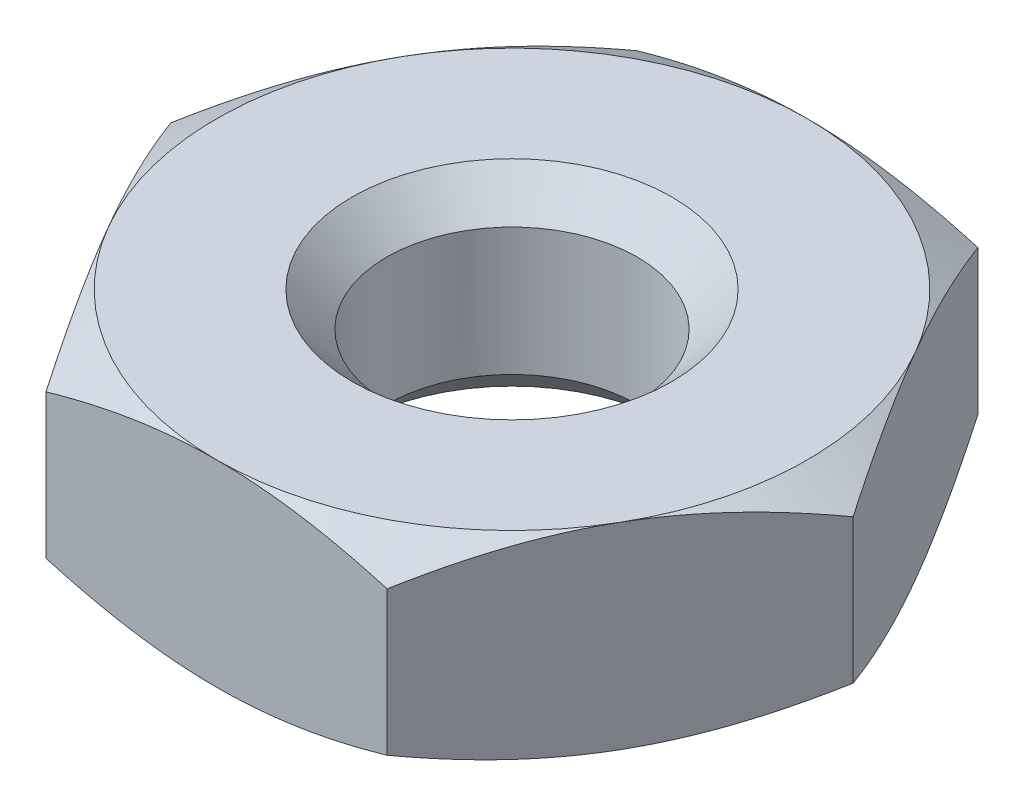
ISO-10303-21;
HEADER;
FILE_DESCRIPTION(('STEP AP214'),'2;1');
FILE_NAME('part.step','',(''),(''),'','','');
FILE_SCHEMA(('AUTOMOTIVE_DESIGN { 1 0 10303 214 1 1 1 1 }'));
ENDSEC;
DATA;
#1=APPLICATION_CONTEXT('core data for automotive mechanical design processes');
#2=APPLICATION_PROTOCOL_DEFINITION('international standard','automotive_design',2000,#1);
#3=PRODUCT_CONTEXT('',#1,'mechanical');
#4=PRODUCT('Part','Part','',(#3));
#5=PRODUCT_RELATED_PRODUCT_CATEGORY('part','',(#4));
#6=PRODUCT_DEFINITION_FORMATION('','',#4);
#7=PRODUCT_DEFINITION_CONTEXT('part definition',#1,'design');
#8=PRODUCT_DEFINITION('design','',#6,#7);
#9=PRODUCT_DEFINITION_SHAPE('','',#8);
#10=(LENGTH_UNIT() NAMED_UNIT(*) SI_UNIT(.MILLI.,.METRE.));
#11=(NAMED_UNIT(*) PLANE_ANGLE_UNIT() SI_UNIT($,.RADIAN.));
#12=(NAMED_UNIT(*) SI_UNIT($,.STERADIAN.) SOLID_ANGLE_UNIT());
#13=UNCERTAINTY_MEASURE_WITH_UNIT(LENGTH_MEASURE(1.E-05),#10,'distance_accuracy_value','');
#14=(GEOMETRIC_REPRESENTATION_CONTEXT(3) GLOBAL_UNCERTAINTY_ASSIGNED_CONTEXT((#13)) GLOBAL_UNIT_ASSIGNED_CONTEXT((#10,
#11,#12)) REPRESENTATION_CONTEXT('',''));
#15=CARTESIAN_POINT('',(0.,0.,0.));
#16=DIRECTION('',(0.,0.,1.));
#17=DIRECTION('',(1.,0.,0.));
#18=AXIS2_PLACEMENT_3D('',#15,#16,#17);
#19=CARTESIAN_POINT('',(0.,-1.09676599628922,21.2574156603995));
#20=DIRECTION('',(0.,1.,0.));
#21=DIRECTION('',(0.,0.,1.));
#22=AXIS2_PLACEMENT_3D('',#19,#20,#21);
#23=PLANE('',#22);
#24=CARTESIAN_POINT('',(0.,-1.09676599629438,23.8460454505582));
#25=DIRECTION('',(0.,-1.,0.));
#26=DIRECTION('',(0.,0.,-1.));
#27=AXIS2_PLACEMENT_3D('',#24,#25,#26);
#28=CIRCLE('',#27,4.76250000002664);
#29=CARTESIAN_POINT('',(4.12444598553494,-1.09676599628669,26.2272954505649));
#30=VERTEX_POINT('',#29);
#31=CARTESIAN_POINT('',(0.,-1.09676599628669,28.6085454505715));
#32=VERTEX_POINT('',#31);
#33=EDGE_CURVE('E125',#30,#32,#28,.T.);
#34=ORIENTED_EDGE('',*,*,#33,.F.);
#35=CARTESIAN_POINT('',(0.,-1.09676599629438,23.8460454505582));
#36=DIRECTION('',(0.,-1.,0.));
#37=DIRECTION('',(0.,0.,-1.));
#38=AXIS2_PLACEMENT_3D('',#35,#36,#37);
#39=CIRCLE('',#38,4.76250000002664);
#40=CARTESIAN_POINT('',(4.12444598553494,-1.09676599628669,21.4647954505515));
#41=VERTEX_POINT('',#40);
#42=EDGE_CURVE('E373',#41,#30,#39,.T.);
#43=ORIENTED_EDGE('',*,*,#42,.F.);
#44=CARTESIAN_POINT('',(0.,-1.09676599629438,23.8460454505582));
#45=DIRECTION('',(0.,-1.,0.));
#46=DIRECTION('',(0.,0.,-1.));
#47=AXIS2_PLACEMENT_3D('',#44,#45,#46);
#48=CIRCLE('',#47,4.76250000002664);
#49=CARTESIAN_POINT('',(0.,-1.09676599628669,19.0835454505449));
#50=VERTEX_POINT('',#49);
#51=EDGE_CURVE('E375',#50,#41,#48,.T.);
#52=ORIENTED_EDGE('',*,*,#51,.F.);
#53=CARTESIAN_POINT('',(0.,-1.09676599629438,23.8460454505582));
#54=DIRECTION('',(0.,-1.,0.));
#55=DIRECTION('',(0.,0.,-1.));
#56=AXIS2_PLACEMENT_3D('',#53,#54,#55);
#57=CIRCLE('',#56,4.76250000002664);
#58=CARTESIAN_POINT('',(-4.12444598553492,-1.09676599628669,21.4647954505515));
#59=VERTEX_POINT('',#58);
#60=EDGE_CURVE('E111',#59,#50,#57,.T.);
#61=ORIENTED_EDGE('',*,*,#60,.F.);
#62=CARTESIAN_POINT('',(0.,-1.09676599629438,23.8460454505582));
#63=DIRECTION('',(0.,-1.,0.));
#64=DIRECTION('',(0.,0.,-1.));
#65=AXIS2_PLACEMENT_3D('',#62,#63,#64);
#66=CIRCLE('',#65,4.76250000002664);
#67=CARTESIAN_POINT('',(-4.12444598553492,-1.09676599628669,26.2272954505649));
#68=VERTEX_POINT('',#67);
#69=EDGE_CURVE('E105',#68,#59,#66,.T.);
#70=ORIENTED_EDGE('',*,*,#69,.F.);
#71=CARTESIAN_POINT('',(0.,-1.09676599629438,23.8460454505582));
#72=DIRECTION('',(0.,-1.,0.));
#73=DIRECTION('',(0.,0.,-1.));
#74=AXIS2_PLACEMENT_3D('',#71,#72,#73);
#75=CIRCLE('',#74,4.76250000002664);
#76=EDGE_CURVE('E108',#32,#68,#75,.T.);
#77=ORIENTED_EDGE('',*,*,#76,.F.);
#78=EDGE_LOOP('',(#34,#43,#52,#61,#70,#77));
#79=FACE_BOUND('',#78,.T.);
#80=CARTESIAN_POINT('',(0.,-1.09676599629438,23.8460454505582));
#81=DIRECTION('',(0.,1.,0.));
#82=DIRECTION('',(-1.,0.,0.));
#83=AXIS2_PLACEMENT_3D('',#80,#81,#82);
#84=CIRCLE('',#83,2.57810000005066);
#85=CARTESIAN_POINT('',(-2.57810000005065,-1.09676599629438,23.8460454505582));
#86=VERTEX_POINT('',#85);
#87=EDGE_CURVE('E20',#86,#86,#84,.F.);
#88=ORIENTED_EDGE('',*,*,#87,.T.);
#89=EDGE_LOOP('',(#88));
#90=FACE_BOUND('',#89,.T.);
#91=ADVANCED_FACE('F17',(#79,#90),#23,.T.);
#92=CARTESIAN_POINT('',(0.,-1.09676599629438,23.8460454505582));
#93=DIRECTION('',(0.,1.,0.));
#94=DIRECTION('',(-1.,0.,0.));
#95=AXIS2_PLACEMENT_3D('',#92,#93,#94);
#96=CONICAL_SURFACE('',#95,2.57810000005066,0.785398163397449);
#97=CARTESIAN_POINT('',(0.,-1.65556599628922,23.8460454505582));
#98=DIRECTION('',(0.,-1.,0.));
#99=DIRECTION('',(0.,0.,-1.));
#100=AXIS2_PLACEMENT_3D('',#97,#98,#99);
#101=CIRCLE('',#100,2.0193);
#102=CARTESIAN_POINT('',(0.,-1.65556599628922,21.8267454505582));
#103=VERTEX_POINT('',#102);
#104=EDGE_CURVE('E124',#103,#103,#101,.T.);
#105=ORIENTED_EDGE('',*,*,#104,.T.);
#106=EDGE_LOOP('',(#105));
#107=FACE_BOUND('',#106,.T.);
#108=ORIENTED_EDGE('',*,*,#87,.F.);
#109=EDGE_LOOP('',(#108));
#110=FACE_BOUND('',#109,.T.);
#111=ADVANCED_FACE('F580',(#107,#110),#96,.F.);
#112=CARTESIAN_POINT('',(0.,-1.52468755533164,23.8460454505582));
#113=DIRECTION('',(0.,-1.,0.));
#114=DIRECTION('',(0.,0.,-1.));
#115=AXIS2_PLACEMENT_3D('',#112,#113,#114);
#116=CONICAL_SURFACE('',#115,5.50368188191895,1.04719755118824);
#117=CARTESIAN_POINT('',(-4.12444598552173,-1.0967659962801,26.2272954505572));
#118=CARTESIAN_POINT('',(-4.18279918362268,-1.09674653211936,26.1262247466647));
#119=CARTESIAN_POINT('',(-4.24114957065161,-1.09924229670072,26.0251589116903));
#120=CARTESIAN_POINT('',(-4.35773577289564,-1.10911961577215,25.8232256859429));
#121=CARTESIAN_POINT('',(-4.41597160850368,-1.1165002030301,25.7223582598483));
#122=CARTESIAN_POINT('',(-4.53195255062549,-1.1359538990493,25.5214733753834));
#123=CARTESIAN_POINT('',(-4.58969865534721,-1.1480033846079,25.4214541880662));
#124=CARTESIAN_POINT('',(-4.70491574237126,-1.17653568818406,25.2218923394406));
#125=CARTESIAN_POINT('',(-4.76238671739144,-1.19301862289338,25.1223496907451));
#126=CARTESIAN_POINT('',(-4.93414872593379,-1.24860839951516,24.8248491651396));
#127=CARTESIAN_POINT('',(-5.04794078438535,-1.29388320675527,24.6277555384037));
#128=CARTESIAN_POINT('',(-5.27454633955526,-1.39829849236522,24.235263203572));
#129=CARTESIAN_POINT('',(-5.3873519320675,-1.45750821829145,24.0398781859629));
#130=CARTESIAN_POINT('',(-5.49926131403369,-1.52213533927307,23.8460454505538));
#131=B_SPLINE_CURVE_WITH_KNOTS('',3,(#117,#118,#119,#120,#121,#122,#123,#124,#125,#126,#127,
#128,#129,#130),.UNSPECIFIED.,.F.,.F.,(4,2,2,2,2,2,4),(0.,0.350083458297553,0.700097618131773,
1.04836346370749,1.39663847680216,2.09227568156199,2.79144559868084),.UNSPECIFIED.);
#132=CARTESIAN_POINT('',(-5.49926131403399,-1.52213533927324,23.846045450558));
#133=VERTEX_POINT('',#132);
#134=EDGE_CURVE('E128',#68,#133,#131,.T.);
#135=ORIENTED_EDGE('',*,*,#134,.F.);
#136=ORIENTED_EDGE('',*,*,#69,.T.);
#137=CARTESIAN_POINT('',(-5.49926131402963,-1.52213533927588,23.8460454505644));
#138=CARTESIAN_POINT('',(-5.38735193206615,-1.45750821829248,23.6522127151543));
#139=CARTESIAN_POINT('',(-5.27454633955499,-1.39829849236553,23.4568276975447));
#140=CARTESIAN_POINT('',(-5.04794078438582,-1.29388320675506,23.0643353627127));
#141=CARTESIAN_POINT('',(-4.93414872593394,-1.24860839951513,22.8672417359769));
#142=CARTESIAN_POINT('',(-4.76238671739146,-1.19301862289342,22.5697412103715));
#143=CARTESIAN_POINT('',(-4.70491574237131,-1.1765356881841,22.470198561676));
#144=CARTESIAN_POINT('',(-4.58969865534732,-1.14800338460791,22.2706367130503));
#145=CARTESIAN_POINT('',(-4.53195255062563,-1.13595389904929,22.1706175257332));
#146=CARTESIAN_POINT('',(-4.41597160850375,-1.11650020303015,21.9697326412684));
#147=CARTESIAN_POINT('',(-4.3577357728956,-1.10911961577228,21.8688652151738));
#148=CARTESIAN_POINT('',(-4.2411495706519,-1.09924229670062,21.6669319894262));
#149=CARTESIAN_POINT('',(-4.18279918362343,-1.09674653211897,21.5658661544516));
#150=CARTESIAN_POINT('',(-4.12444598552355,-1.096765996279,21.4647954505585));
#151=B_SPLINE_CURVE_WITH_KNOTS('',3,(#137,#138,#139,#140,#141,#142,#143,#144,#145,#146,#147,
#148,#149,#150),.UNSPECIFIED.,.F.,.F.,(4,2,2,2,2,2,4),(0.,0.699169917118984,1.3948071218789,
1.74308213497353,2.09134798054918,2.44136214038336,2.79144559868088),.UNSPECIFIED.);
#152=EDGE_CURVE('E131',#133,#59,#151,.T.);
#153=ORIENTED_EDGE('',*,*,#152,.F.);
#154=EDGE_LOOP('',(#135,#136,#153));
#155=FACE_BOUND('',#154,.T.);
#156=ADVANCED_FACE('F129',(#155),#116,.T.);
#157=CARTESIAN_POINT('',(0.,-1.52468755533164,23.8460454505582));
#158=DIRECTION('',(0.,-1.,0.));
#159=DIRECTION('',(0.,0.,-1.));
#160=AXIS2_PLACEMENT_3D('',#157,#158,#159);
#161=CONICAL_SURFACE('',#160,5.50368188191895,1.04719755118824);
#162=ORIENTED_EDGE('',*,*,#60,.T.);
#163=CARTESIAN_POINT('',(-2.74963065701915,-1.52213533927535,19.0835454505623));
#164=CARTESIAN_POINT('',(-2.52581189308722,-1.45750821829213,19.0835454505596));
#165=CARTESIAN_POINT('',(-2.30020070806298,-1.39829849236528,19.0835454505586));
#166=CARTESIAN_POINT('',(-1.8469895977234,-1.29388320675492,19.0835454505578));
#167=CARTESIAN_POINT('',(-1.6194054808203,-1.24860839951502,19.0835454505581));
#168=CARTESIAN_POINT('',(-1.27588146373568,-1.19301862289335,19.0835454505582));
#169=CARTESIAN_POINT('',(-1.16093951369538,-1.17653568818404,19.0835454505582));
#170=CARTESIAN_POINT('',(-0.930505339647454,-1.14800338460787,19.0835454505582));
#171=CARTESIAN_POINT('',(-0.815013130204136,-1.13595389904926,19.0835454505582));
#172=CARTESIAN_POINT('',(-0.583051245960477,-1.11650020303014,19.0835454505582));
#173=CARTESIAN_POINT('',(-0.466579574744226,-1.10911961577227,19.0835454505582));
#174=CARTESIAN_POINT('',(-0.233407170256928,-1.09924229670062,19.0835454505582));
#175=CARTESIAN_POINT('',(-0.116706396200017,-1.09674653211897,19.0835454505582));
#176=CARTESIAN_POINT('',(-3.08387872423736E-13,-1.096765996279,19.0835454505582));
#177=B_SPLINE_CURVE_WITH_KNOTS('',3,(#163,#164,#165,#166,#167,#168,#169,#170,#171,#172,#173,
#174,#175,#176),.UNSPECIFIED.,.F.,.F.,(4,2,2,2,2,2,4),(0.,0.699169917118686,1.39480712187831,
1.74308213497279,2.09134798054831,2.44136214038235,2.79144559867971),.UNSPECIFIED.);
#178=CARTESIAN_POINT('',(-2.74963065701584,-1.52213533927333,19.0835454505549));
#179=VERTEX_POINT('',#178);
#180=EDGE_CURVE('E291',#179,#50,#177,.T.);
#181=ORIENTED_EDGE('',*,*,#180,.F.);
#182=CARTESIAN_POINT('',(-4.12444598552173,-1.09676599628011,21.4647954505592));
#183=CARTESIAN_POINT('',(-4.06609278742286,-1.09674653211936,21.3637247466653));
#184=CARTESIAN_POINT('',(-4.00774240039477,-1.09924229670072,21.2626589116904));
#185=CARTESIAN_POINT('',(-3.8911561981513,-1.10911961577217,21.0607256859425));
#186=CARTESIAN_POINT('',(-3.832920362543,-1.11650020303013,20.9598582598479));
#187=CARTESIAN_POINT('',(-3.71693942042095,-1.13595389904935,20.758973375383));
#188=CARTESIAN_POINT('',(-3.65919331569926,-1.14800338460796,20.6589541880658));
#189=CARTESIAN_POINT('',(-3.54397622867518,-1.17653568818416,20.4593923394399));
#190=CARTESIAN_POINT('',(-3.48650525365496,-1.19301862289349,20.3598496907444));
#191=CARTESIAN_POINT('',(-3.31474324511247,-1.24860839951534,20.0623491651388));
#192=CARTESIAN_POINT('',(-3.20095118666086,-1.2938832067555,19.8652555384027));
#193=CARTESIAN_POINT('',(-2.97434563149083,-1.39829849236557,19.4727632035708));
#194=CARTESIAN_POINT('',(-2.86154003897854,-1.45750821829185,19.2773781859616));
#195=CARTESIAN_POINT('',(-2.74963065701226,-1.52213533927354,19.0835454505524));
#196=B_SPLINE_CURVE_WITH_KNOTS('',3,(#182,#183,#184,#185,#186,#187,#188,#189,#190,#191,#192,
#193,#194,#195),.UNSPECIFIED.,.F.,.F.,(4,2,2,2,2,2,4),(0.,0.350083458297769,0.700097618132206,
1.04836346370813,1.39663847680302,2.09227568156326,2.79144559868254),.UNSPECIFIED.);
#197=EDGE_CURVE('E287',#59,#179,#196,.T.);
#198=ORIENTED_EDGE('',*,*,#197,.F.);
#199=EDGE_LOOP('',(#162,#181,#198));
#200=FACE_BOUND('',#199,.T.);
#201=ADVANCED_FACE('F277',(#200),#161,.T.);
#202=CARTESIAN_POINT('',(0.,-1.52468755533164,23.8460454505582));
#203=DIRECTION('',(0.,-1.,0.));
#204=DIRECTION('',(0.,0.,-1.));
#205=AXIS2_PLACEMENT_3D('',#202,#203,#204);
#206=CONICAL_SURFACE('',#205,5.50368188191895,1.04719755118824);
#207=ORIENTED_EDGE('',*,*,#51,.T.);
#208=CARTESIAN_POINT('',(2.74963065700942,-1.52213533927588,19.0835454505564));
#209=CARTESIAN_POINT('',(2.86154003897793,-1.45750821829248,19.2773781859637));
#210=CARTESIAN_POINT('',(2.97434563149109,-1.39829849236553,19.4727632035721));
#211=CARTESIAN_POINT('',(3.20095118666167,-1.29388320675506,19.8652555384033));
#212=CARTESIAN_POINT('',(3.31474324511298,-1.24860839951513,20.0623491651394));
#213=CARTESIAN_POINT('',(3.48650525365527,-1.19301862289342,20.359849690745));
#214=CARTESIAN_POINT('',(3.54397622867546,-1.1765356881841,20.4593923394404));
#215=CARTESIAN_POINT('',(3.65919331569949,-1.14800338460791,20.6589541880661));
#216=CARTESIAN_POINT('',(3.71693942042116,-1.13595389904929,20.7589733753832));
#217=CARTESIAN_POINT('',(3.83292036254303,-1.11650020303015,20.959858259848));
#218=CARTESIAN_POINT('',(3.89115619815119,-1.10911961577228,21.0607256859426));
#219=CARTESIAN_POINT('',(4.00774240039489,-1.09924229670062,21.2626589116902));
#220=CARTESIAN_POINT('',(4.06609278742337,-1.09674653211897,21.3637247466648));
#221=CARTESIAN_POINT('',(4.12444598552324,-1.096765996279,21.4647954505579));
#222=B_SPLINE_CURVE_WITH_KNOTS('',3,(#208,#209,#210,#211,#212,#213,#214,#215,#216,#217,#218,
#219,#220,#221),.UNSPECIFIED.,.F.,.F.,(4,2,2,2,2,2,4),(0.,0.699169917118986,1.39480712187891,
1.74308213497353,2.09134798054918,2.44136214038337,2.79144559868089),.UNSPECIFIED.);
#223=CARTESIAN_POINT('',(2.74963065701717,-1.52213533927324,19.0835454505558));
#224=VERTEX_POINT('',#223);
#225=EDGE_CURVE('E259',#224,#41,#222,.T.);
#226=ORIENTED_EDGE('',*,*,#225,.F.);
#227=CARTESIAN_POINT('',(0.,-1.09676599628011,19.0835454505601));
#228=CARTESIAN_POINT('',(0.116706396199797,-1.09674653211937,19.0835454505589));
#229=CARTESIAN_POINT('',(0.233407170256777,-1.09924229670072,19.0835454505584));
#230=CARTESIAN_POINT('',(0.466579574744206,-1.10911961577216,19.083545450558));
#231=CARTESIAN_POINT('',(0.583051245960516,-1.11650020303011,19.0835454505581));
#232=CARTESIAN_POINT('',(0.8150131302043,-1.1359538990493,19.0835454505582));
#233=CARTESIAN_POINT('',(0.930505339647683,-1.14800338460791,19.0835454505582));
#234=CARTESIAN_POINT('',(1.16093951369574,-1.17653568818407,19.0835454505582));
#235=CARTESIAN_POINT('',(1.27588146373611,-1.19301862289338,19.0835454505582));
#236=CARTESIAN_POINT('',(1.61940548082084,-1.24860839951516,19.0835454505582));
#237=CARTESIAN_POINT('',(1.84698959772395,-1.29388320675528,19.0835454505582));
#238=CARTESIAN_POINT('',(2.30020070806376,-1.39829849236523,19.0835454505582));
#239=CARTESIAN_POINT('',(2.52581189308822,-1.45750821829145,19.0835454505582));
#240=CARTESIAN_POINT('',(2.74963065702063,-1.52213533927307,19.0835454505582));
#241=B_SPLINE_CURVE_WITH_KNOTS('',3,(#227,#228,#229,#230,#231,#232,#233,#234,#235,#236,#237,
#238,#239,#240),.UNSPECIFIED.,.F.,.F.,(4,2,2,2,2,2,4),(0.,0.350083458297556,0.70009761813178,
1.04836346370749,1.39663847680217,2.09227568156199,2.79144559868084),.UNSPECIFIED.);
#242=EDGE_CURVE('E267',#50,#224,#241,.T.);
#243=ORIENTED_EDGE('',*,*,#242,.F.);
#244=EDGE_LOOP('',(#207,#226,#243));
#245=FACE_BOUND('',#244,.T.);
#246=ADVANCED_FACE('F272',(#245),#206,.T.);
#247=CARTESIAN_POINT('',(0.,-1.52468755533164,23.8460454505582));
#248=DIRECTION('',(0.,-1.,0.));
#249=DIRECTION('',(0.,0.,-1.));
#250=AXIS2_PLACEMENT_3D('',#247,#248,#249);
#251=CONICAL_SURFACE('',#250,5.50368188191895,1.04719755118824);
#252=ORIENTED_EDGE('',*,*,#42,.T.);
#253=CARTESIAN_POINT('',(5.4992613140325,-1.52213533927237,23.8460454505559));
#254=CARTESIAN_POINT('',(5.38735193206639,-1.45750821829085,24.0398781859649));
#255=CARTESIAN_POINT('',(5.27454633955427,-1.39829849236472,24.2352632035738));
#256=CARTESIAN_POINT('',(5.04794078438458,-1.29388320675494,24.627755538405));
#257=CARTESIAN_POINT('',(4.93414872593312,-1.2486083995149,24.8248491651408));
#258=CARTESIAN_POINT('',(4.76238671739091,-1.19301862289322,25.122349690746));
#259=CARTESIAN_POINT('',(4.70491574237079,-1.17653568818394,25.2218923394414));
#260=CARTESIAN_POINT('',(4.58969865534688,-1.14800338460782,25.4214541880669));
#261=CARTESIAN_POINT('',(4.53195255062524,-1.13595389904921,25.5214733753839));
#262=CARTESIAN_POINT('',(4.41597160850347,-1.11650020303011,25.7223582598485));
#263=CARTESIAN_POINT('',(4.35773577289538,-1.10911961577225,25.823225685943));
#264=CARTESIAN_POINT('',(4.2411495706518,-1.09924229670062,26.0251589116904));
#265=CARTESIAN_POINT('',(4.18279918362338,-1.09674653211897,26.1262247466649));
#266=CARTESIAN_POINT('',(4.12444598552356,-1.096765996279,26.2272954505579));
#267=B_SPLINE_CURVE_WITH_KNOTS('',3,(#253,#254,#255,#256,#257,#258,#259,#260,#261,#262,#263,
#264,#265,#266),.UNSPECIFIED.,.F.,.F.,(4,2,2,2,2,2,4),(0.,0.699169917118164,1.39480712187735,
1.74308213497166,2.09134798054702,2.44136214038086,2.79144559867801),.UNSPECIFIED.);
#268=CARTESIAN_POINT('',(5.49926131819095,-1.52213534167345,23.8460454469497));
#269=VERTEX_POINT('',#268);
#270=EDGE_CURVE('E367',#269,#30,#267,.T.);
#271=ORIENTED_EDGE('',*,*,#270,.F.);
#272=CARTESIAN_POINT('',(4.12444598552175,-1.09676599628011,21.4647954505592));
#273=CARTESIAN_POINT('',(4.18279918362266,-1.09674653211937,21.5658661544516));
#274=CARTESIAN_POINT('',(4.24114957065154,-1.09924229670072,21.6669319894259));
#275=CARTESIAN_POINT('',(4.35773577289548,-1.10911961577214,21.8688652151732));
#276=CARTESIAN_POINT('',(4.41597160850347,-1.11650020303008,21.9697326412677));
#277=CARTESIAN_POINT('',(4.53195255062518,-1.13595389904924,22.1706175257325));
#278=CARTESIAN_POINT('',(4.58969865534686,-1.14800338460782,22.2706367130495));
#279=CARTESIAN_POINT('',(4.70491574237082,-1.17653568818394,22.4701985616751));
#280=CARTESIAN_POINT('',(4.76238671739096,-1.19301862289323,22.5697412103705));
#281=CARTESIAN_POINT('',(4.93414872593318,-1.24860839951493,22.8672417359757));
#282=CARTESIAN_POINT('',(5.04794078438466,-1.29388320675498,23.0643353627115));
#283=CARTESIAN_POINT('',(5.2745463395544,-1.39829849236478,23.4568276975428));
#284=CARTESIAN_POINT('',(5.38735193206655,-1.45750821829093,23.6522127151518));
#285=CARTESIAN_POINT('',(5.49926131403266,-1.52213533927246,23.8460454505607));
#286=B_SPLINE_CURVE_WITH_KNOTS('',3,(#272,#273,#274,#275,#276,#277,#278,#279,#280,#281,#282,
#283,#284,#285),.UNSPECIFIED.,.F.,.F.,(4,2,2,2,2,2,4),(0.,0.35008345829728,0.700097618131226,
1.04836346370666,1.39663847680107,2.09227568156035,2.79144559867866),.UNSPECIFIED.);
#287=EDGE_CURVE('E252',#41,#269,#286,.T.);
#288=ORIENTED_EDGE('',*,*,#287,.F.);
#289=EDGE_LOOP('',(#252,#271,#288));
#290=FACE_BOUND('',#289,.T.);
#291=ADVANCED_FACE('F276',(#290),#251,.T.);
#292=CARTESIAN_POINT('',(0.,-1.52468755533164,23.8460454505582));
#293=DIRECTION('',(0.,-1.,0.));
#294=DIRECTION('',(0.,0.,-1.));
#295=AXIS2_PLACEMENT_3D('',#292,#293,#294);
#296=CONICAL_SURFACE('',#295,5.50368188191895,1.04719755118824);
#297=CARTESIAN_POINT('',(4.12444598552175,-1.0967659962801,26.2272954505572));
#298=CARTESIAN_POINT('',(4.06609278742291,-1.09674653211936,26.328366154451));
#299=CARTESIAN_POINT('',(4.00774240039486,-1.09924229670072,26.4294319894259));
#300=CARTESIAN_POINT('',(3.89115619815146,-1.10911961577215,26.6313652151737));
#301=CARTESIAN_POINT('',(3.83292036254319,-1.1165002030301,26.7322326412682));
#302=CARTESIAN_POINT('',(3.71693942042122,-1.1359538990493,26.933117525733));
#303=CARTESIAN_POINT('',(3.65919331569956,-1.1480033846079,27.0331367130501));
#304=CARTESIAN_POINT('',(3.54397622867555,-1.17653568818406,27.2326985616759));
#305=CARTESIAN_POINT('',(3.48650525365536,-1.19301862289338,27.3322412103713));
#306=CARTESIAN_POINT('',(3.31474324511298,-1.24860839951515,27.6297417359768));
#307=CARTESIAN_POINT('',(3.20095118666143,-1.29388320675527,27.8268353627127));
#308=CARTESIAN_POINT('',(2.97434563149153,-1.39829849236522,28.2193276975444));
#309=CARTESIAN_POINT('',(2.8615400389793,-1.45750821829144,28.4147127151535));
#310=CARTESIAN_POINT('',(2.74963065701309,-1.52213533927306,28.6085454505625));
#311=B_SPLINE_CURVE_WITH_KNOTS('',3,(#297,#298,#299,#300,#301,#302,#303,#304,#305,#306,#307,
#308,#309,#310),.UNSPECIFIED.,.F.,.F.,(4,2,2,2,2,2,4),(0.,0.350083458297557,0.700097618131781,
1.04836346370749,1.39663847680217,2.09227568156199,2.79144559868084),.UNSPECIFIED.);
#312=CARTESIAN_POINT('',(2.74963065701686,-1.52213533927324,28.6085454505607));
#313=VERTEX_POINT('',#312);
#314=EDGE_CURVE('E355',#30,#313,#311,.T.);
#315=ORIENTED_EDGE('',*,*,#314,.F.);
#316=ORIENTED_EDGE('',*,*,#33,.T.);
#317=CARTESIAN_POINT('',(2.74963065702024,-1.52213533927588,28.6085454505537));
#318=CARTESIAN_POINT('',(2.52581189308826,-1.45750821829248,28.6085454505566));
#319=CARTESIAN_POINT('',(2.30020070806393,-1.39829849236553,28.6085454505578));
#320=CARTESIAN_POINT('',(1.84698959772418,-1.29388320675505,28.6085454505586));
#321=CARTESIAN_POINT('',(1.61940548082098,-1.24860839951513,28.6085454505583));
#322=CARTESIAN_POINT('',(1.27588146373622,-1.19301862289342,28.6085454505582));
#323=CARTESIAN_POINT('',(1.16093951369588,-1.1765356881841,28.6085454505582));
#324=CARTESIAN_POINT('',(0.930505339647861,-1.1480033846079,28.6085454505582));
#325=CARTESIAN_POINT('',(0.815013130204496,-1.13595389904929,28.6085454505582));
#326=CARTESIAN_POINT('',(0.583051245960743,-1.11650020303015,28.6085454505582));
#327=CARTESIAN_POINT('',(0.466579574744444,-1.10911961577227,28.6085454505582));
#328=CARTESIAN_POINT('',(0.233407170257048,-1.09924229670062,28.6085454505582));
#329=CARTESIAN_POINT('',(0.116706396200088,-1.09674653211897,28.6085454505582));
#330=CARTESIAN_POINT('',(3.2958442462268E-13,-1.096765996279,28.6085454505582));
#331=B_SPLINE_CURVE_WITH_KNOTS('',3,(#317,#318,#319,#320,#321,#322,#323,#324,#325,#326,#327,
#328,#329,#330),.UNSPECIFIED.,.F.,.F.,(4,2,2,2,2,2,4),(0.,0.699169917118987,1.39480712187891,
1.74308213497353,2.09134798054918,2.44136214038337,2.79144559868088),.UNSPECIFIED.);
#332=EDGE_CURVE('E170',#313,#32,#331,.T.);
#333=ORIENTED_EDGE('',*,*,#332,.F.);
#334=EDGE_LOOP('',(#315,#316,#333));
#335=FACE_BOUND('',#334,.T.);
#336=ADVANCED_FACE('F159',(#335),#296,.T.);
#337=CARTESIAN_POINT('',(0.,-1.52468755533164,23.8460454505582));
#338=DIRECTION('',(0.,-1.,0.));
#339=DIRECTION('',(0.,0.,-1.));
#340=AXIS2_PLACEMENT_3D('',#337,#338,#339);
#341=CONICAL_SURFACE('',#340,5.50368188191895,1.04719755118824);
#342=CARTESIAN_POINT('',(0.,-1.0967659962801,28.6085454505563));
#343=CARTESIAN_POINT('',(-0.116706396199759,-1.09674653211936,28.6085454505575));
#344=CARTESIAN_POINT('',(-0.233407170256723,-1.09924229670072,28.608545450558));
#345=CARTESIAN_POINT('',(-0.466579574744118,-1.10911961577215,28.6085454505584));
#346=CARTESIAN_POINT('',(-0.583051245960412,-1.1165002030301,28.6085454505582));
#347=CARTESIAN_POINT('',(-0.815013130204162,-1.13595389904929,28.6085454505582));
#348=CARTESIAN_POINT('',(-0.930505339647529,-1.14800338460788,28.6085454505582));
#349=CARTESIAN_POINT('',(-1.16093951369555,-1.17653568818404,28.6085454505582));
#350=CARTESIAN_POINT('',(-1.2758814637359,-1.19301862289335,28.6085454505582));
#351=CARTESIAN_POINT('',(-1.61940548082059,-1.24860839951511,28.6085454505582));
#352=CARTESIAN_POINT('',(-1.84698959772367,-1.29388320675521,28.6085454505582));
#353=CARTESIAN_POINT('',(-2.30020070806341,-1.39829849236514,28.6085454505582));
#354=CARTESIAN_POINT('',(-2.52581189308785,-1.45750821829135,28.6085454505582));
#355=CARTESIAN_POINT('',(-2.74963065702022,-1.52213533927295,28.6085454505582));
#356=B_SPLINE_CURVE_WITH_KNOTS('',3,(#342,#343,#344,#345,#346,#347,#348,#349,#350,#351,#352,
#353,#354,#355),.UNSPECIFIED.,.F.,.F.,(4,2,2,2,2,2,4),(0.,0.350083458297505,0.700097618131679,
1.04836346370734,1.39663847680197,2.09227568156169,2.79144559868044),.UNSPECIFIED.);
#357=CARTESIAN_POINT('',(-2.74963065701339,-1.52213533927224,28.6085454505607));
#358=VERTEX_POINT('',#357);
#359=EDGE_CURVE('E122',#32,#358,#356,.T.);
#360=ORIENTED_EDGE('',*,*,#359,.F.);
#361=ORIENTED_EDGE('',*,*,#76,.T.);
#362=CARTESIAN_POINT('',(-2.74963065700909,-1.52213533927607,28.6085454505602));
#363=CARTESIAN_POINT('',(-2.86154003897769,-1.4575082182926,28.414712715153));
#364=CARTESIAN_POINT('',(-2.97434563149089,-1.39829849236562,28.2193276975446));
#365=CARTESIAN_POINT('',(-3.20095118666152,-1.2938832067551,27.8268353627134));
#366=CARTESIAN_POINT('',(-3.31474324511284,-1.24860839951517,27.6297417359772));
#367=CARTESIAN_POINT('',(-3.48650525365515,-1.19301862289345,27.3322412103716));
#368=CARTESIAN_POINT('',(-3.54397622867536,-1.17653568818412,27.2326985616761));
#369=CARTESIAN_POINT('',(-3.6591933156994,-1.14800338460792,27.0331367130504));
#370=CARTESIAN_POINT('',(-3.71693942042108,-1.1359538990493,26.9331175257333));
#371=CARTESIAN_POINT('',(-3.83292036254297,-1.11650020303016,26.7322326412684));
#372=CARTESIAN_POINT('',(-3.89115619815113,-1.10911961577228,26.6313652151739));
#373=CARTESIAN_POINT('',(-4.00774240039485,-1.09924229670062,26.4294319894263));
#374=CARTESIAN_POINT('',(-4.06609278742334,-1.09674653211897,26.3283661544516));
#375=CARTESIAN_POINT('',(-4.12444598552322,-1.096765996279,26.2272954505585));
#376=B_SPLINE_CURVE_WITH_KNOTS('',3,(#362,#363,#364,#365,#366,#367,#368,#369,#370,#371,#372,
#373,#374,#375),.UNSPECIFIED.,.F.,.F.,(4,2,2,2,2,2,4),(0.,0.699169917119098,1.39480712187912,
1.7430821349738,2.0913479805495,2.44136214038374,2.79144559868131),.UNSPECIFIED.);
#377=EDGE_CURVE('E119',#358,#68,#376,.T.);
#378=ORIENTED_EDGE('',*,*,#377,.F.);
#379=EDGE_LOOP('',(#360,#361,#378));
#380=FACE_BOUND('',#379,.T.);
#381=ADVANCED_FACE('F117',(#380),#341,.T.);
#382=CARTESIAN_POINT('',(0.,-5.37000333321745,23.8460454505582));
#383=DIRECTION('',(0.,-1.,0.));
#384=DIRECTION('',(0.,0.,-1.));
#385=AXIS2_PLACEMENT_3D('',#382,#383,#384);
#386=CYLINDRICAL_SURFACE('',#385,2.0193);
#387=CARTESIAN_POINT('',(0.,-3.71296599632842,23.8460454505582));
#388=DIRECTION('',(0.,-1.,0.));
#389=DIRECTION('',(1.,0.,0.));
#390=AXIS2_PLACEMENT_3D('',#387,#388,#389);
#391=CIRCLE('',#390,2.01929999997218);
#392=CARTESIAN_POINT('',(2.01929999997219,-3.71296599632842,23.8460454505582));
#393=VERTEX_POINT('',#392);
#394=EDGE_CURVE('E307',#393,#393,#391,.T.);
#395=ORIENTED_EDGE('',*,*,#394,.T.);
#396=EDGE_LOOP('',(#395));
#397=FACE_BOUND('',#396,.T.);
#398=ORIENTED_EDGE('',*,*,#104,.F.);
#399=EDGE_LOOP('',(#398));
#400=FACE_BOUND('',#399,.T.);
#401=ADVANCED_FACE('F158',(#397,#400),#386,.F.);
#402=CARTESIAN_POINT('',(-5.49926131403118,-4.27176599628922,23.8460454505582));
#403=DIRECTION('',(-0.866025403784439,0.,0.5));
#404=DIRECTION('',(0.5,0.,0.866025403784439));
#405=AXIS2_PLACEMENT_3D('',#402,#403,#404);
#406=PLANE('',#405);
#407=CARTESIAN_POINT('',(-2.74963063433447,-3.84639664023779,28.608545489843));
#408=CARTESIAN_POINT('',(-2.86154001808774,-3.91102376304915,28.4147127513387));
#409=CARTESIAN_POINT('',(-2.97434561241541,-3.97023349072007,28.2193277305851));
#410=CARTESIAN_POINT('',(-3.20095117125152,-4.07464877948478,27.8268353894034));
#411=CARTESIAN_POINT('',(-3.31474323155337,-4.11992358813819,27.6297417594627));
#412=CARTESIAN_POINT('',(-3.48650524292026,-4.17551336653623,27.332241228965));
#413=CARTESIAN_POINT('',(-3.54397621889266,-4.19199630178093,27.2326985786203));
#414=CARTESIAN_POINT('',(-3.65919330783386,-4.22052860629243,27.0331367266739));
#415=CARTESIAN_POINT('',(-3.71693941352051,-4.23257809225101,26.9331175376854));
#416=CARTESIAN_POINT('',(-3.83292035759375,-4.25203178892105,26.7322326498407));
#417=CARTESIAN_POINT('',(-3.89115619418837,-4.25941237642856,26.6313652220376));
#418=CARTESIAN_POINT('',(-4.00774239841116,-4.26928969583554,26.4294319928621));
#419=CARTESIAN_POINT('',(-4.06609278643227,-4.27178546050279,26.3283661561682));
#420=CARTESIAN_POINT('',(-4.124445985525,-4.2717659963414,26.2272954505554));
#421=B_SPLINE_CURVE_WITH_KNOTS('',3,(#407,#408,#409,#410,#411,#412,#413,#414,#415,#416,#417,
#418,#419,#420),.UNSPECIFIED.,.F.,.F.,(4,2,2,2,2,2,4),(0.,0.699169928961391,1.39480714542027,
1.74308216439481,2.09134801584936,2.44136218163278,2.79144564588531),.UNSPECIFIED.);
#422=CARTESIAN_POINT('',(-2.7496306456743,-3.84639664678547,28.6085454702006));
#423=VERTEX_POINT('',#422);
#424=CARTESIAN_POINT('',(-4.12444598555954,-4.2717659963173,26.2272954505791));
#425=VERTEX_POINT('',#424);
#426=EDGE_CURVE('E385',#423,#425,#421,.T.);
#427=ORIENTED_EDGE('',*,*,#426,.F.);
#428=DIRECTION('',(0.,-1.,0.));
#429=VECTOR('',#428,1.);
#430=CARTESIAN_POINT('',(-2.74963065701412,-4.27176599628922,28.6085454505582));
#431=LINE('',#430,#429);
#432=EDGE_CURVE('E137',#358,#423,#431,.T.);
#433=ORIENTED_EDGE('',*,*,#432,.F.);
#434=ORIENTED_EDGE('',*,*,#377,.T.);
#435=ORIENTED_EDGE('',*,*,#134,.T.);
#436=DIRECTION('',(0.,1.,0.));
#437=VECTOR('',#436,1.);
#438=CARTESIAN_POINT('',(-5.49926130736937,-4.27176599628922,23.8460454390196));
#439=LINE('',#438,#437);
#440=CARTESIAN_POINT('',(-5.49926127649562,-3.84639667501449,23.8460454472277));
#441=VERTEX_POINT('',#440);
#442=EDGE_CURVE('E296',#441,#133,#439,.T.);
#443=ORIENTED_EDGE('',*,*,#442,.F.);
#444=CARTESIAN_POINT('',(-4.12444598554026,-4.27176599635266,26.2272954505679));
#445=CARTESIAN_POINT('',(-4.18279918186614,-4.27178546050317,26.1262247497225));
#446=CARTESIAN_POINT('',(-4.24114956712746,-4.26928969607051,26.0251589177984));
#447=CARTESIAN_POINT('',(-4.35773576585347,-4.25941237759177,25.8232256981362));
#448=CARTESIAN_POINT('',(-4.41597159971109,-4.25203179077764,25.7223582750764));
#449=CARTESIAN_POINT('',(-4.5319525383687,-4.23257809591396,25.5214733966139));
#450=CARTESIAN_POINT('',(-4.58969864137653,-4.22052861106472,25.4214542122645));
#451=CARTESIAN_POINT('',(-4.70491572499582,-4.19199630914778,25.2218923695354));
#452=CARTESIAN_POINT('',(-4.76238669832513,-4.17551337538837,25.1223497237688));
#453=CARTESIAN_POINT('',(-4.93414870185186,-4.11992360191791,24.8248492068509));
#454=CARTESIAN_POINT('',(-5.04794075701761,-4.07464879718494,24.6277555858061));
#455=CARTESIAN_POINT('',(-5.27454630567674,-3.97023351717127,24.2352632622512));
#456=CARTESIAN_POINT('',(-5.38735189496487,-3.91102379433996,24.0398782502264));
#457=CARTESIAN_POINT('',(-5.49926127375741,-3.84639667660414,23.8460455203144));
#458=B_SPLINE_CURVE_WITH_KNOTS('',3,(#444,#445,#446,#447,#448,#449,#450,#451,#452,#453,#454,
#455,#456,#457),.UNSPECIFIED.,.F.,.F.,(4,2,2,2,2,2,4),(0.,0.350083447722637,0.700097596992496,
1.04836343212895,1.39663843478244,2.09227561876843,2.79144551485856),.UNSPECIFIED.);
#459=EDGE_CURVE('E387',#425,#441,#458,.T.);
#460=ORIENTED_EDGE('',*,*,#459,.F.);
#461=EDGE_LOOP('',(#427,#433,#434,#435,#443,#460));
#462=FACE_BOUND('',#461,.T.);
#463=ADVANCED_FACE('F136',(#462),#406,.T.);
#464=CARTESIAN_POINT('',(-2.74963065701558,-4.27176599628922,19.0835454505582));
#465=DIRECTION('',(-0.866025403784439,0.,-0.5));
#466=DIRECTION('',(-0.5,0.,0.866025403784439));
#467=AXIS2_PLACEMENT_3D('',#464,#465,#466);
#468=PLANE('',#467);
#469=CARTESIAN_POINT('',(-5.49926122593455,-3.8463966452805,23.8460454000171));
#470=CARTESIAN_POINT('',(-5.3873518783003,-3.91102378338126,23.6522126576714));
#471=CARTESIAN_POINT('',(-5.27454630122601,-3.97023351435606,23.4568276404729));
#472=CARTESIAN_POINT('',(-5.04794076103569,-4.07464880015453,23.0643353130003));
#473=CARTESIAN_POINT('',(-4.93414870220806,-4.11992360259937,22.8672416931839));
#474=CARTESIAN_POINT('',(-4.76238669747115,-4.17551337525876,22.5697411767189));
#475=CARTESIAN_POINT('',(-4.70491572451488,-4.19199630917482,22.4701985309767));
#476=CARTESIAN_POINT('',(-4.58969864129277,-4.22052861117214,22.2706366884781));
#477=CARTESIAN_POINT('',(-4.5319525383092,-4.2325780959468,22.1706175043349));
#478=CARTESIAN_POINT('',(-4.41597159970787,-4.25203179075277,21.9697326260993));
#479=CARTESIAN_POINT('',(-4.35773576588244,-4.25941237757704,21.8688652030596));
#480=CARTESIAN_POINT('',(-4.24114956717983,-4.26928969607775,21.6669319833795));
#481=CARTESIAN_POINT('',(-4.18279918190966,-4.27178546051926,21.5658661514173));
#482=CARTESIAN_POINT('',(-4.12444598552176,-4.27176599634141,21.4647954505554));
#483=B_SPLINE_CURVE_WITH_KNOTS('',3,(#469,#470,#471,#472,#473,#474,#475,#476,#477,#478,#479,
#480,#481,#482),.UNSPECIFIED.,.F.,.F.,(4,2,2,2,2,2,4),(0.,0.699169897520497,1.39480708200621,
1.74308208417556,2.09134791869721,2.44136206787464,2.79144551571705),.UNSPECIFIED.);
#484=CARTESIAN_POINT('',(-4.12444598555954,-4.2717659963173,21.4647954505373));
#485=VERTEX_POINT('',#484);
#486=EDGE_CURVE('E410',#441,#485,#483,.T.);
#487=ORIENTED_EDGE('',*,*,#486,.F.);
#488=ORIENTED_EDGE('',*,*,#442,.T.);
#489=ORIENTED_EDGE('',*,*,#152,.T.);
#490=ORIENTED_EDGE('',*,*,#197,.T.);
#491=DIRECTION('',(0.,1.,0.));
#492=VECTOR('',#491,1.);
#493=CARTESIAN_POINT('',(-2.74963067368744,-4.27176599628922,19.0835454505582));
#494=LINE('',#493,#492);
#495=CARTESIAN_POINT('',(-2.74963068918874,-3.84639664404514,19.0835454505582));
#496=VERTEX_POINT('',#495);
#497=EDGE_CURVE('E266',#496,#179,#494,.T.);
#498=ORIENTED_EDGE('',*,*,#497,.F.);
#499=CARTESIAN_POINT('',(-4.12444598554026,-4.27176599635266,21.4647954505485));
#500=CARTESIAN_POINT('',(-4.06609278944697,-4.27178546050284,21.3637247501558));
#501=CARTESIAN_POINT('',(-4.00774240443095,-4.26928969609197,21.2626589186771));
#502=CARTESIAN_POINT('',(-3.89115620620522,-4.25941237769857,21.0607256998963));
#503=CARTESIAN_POINT('',(-3.83292037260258,-4.25203179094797,20.9598582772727));
#504=CARTESIAN_POINT('',(-3.71693943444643,-4.23257809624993,20.7589733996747));
#505=CARTESIAN_POINT('',(-3.65919333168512,-4.22052861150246,20.6589542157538));
#506=CARTESIAN_POINT('',(-3.54397624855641,-4.19199630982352,20.4593923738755));
#507=CARTESIAN_POINT('',(-3.48650527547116,-4.17551337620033,20.3598497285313));
#508=CARTESIAN_POINT('',(-3.31474327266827,-4.11992360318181,20.0623492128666));
#509=CARTESIAN_POINT('',(-3.20095121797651,-4.0746487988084,19.8652555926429));
#510=CARTESIAN_POINT('',(-2.97434567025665,-3.97023351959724,19.4727632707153));
#511=CARTESIAN_POINT('',(-2.86154008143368,-3.9110237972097,19.2773782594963));
#512=CARTESIAN_POINT('',(-2.74963070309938,-3.84639667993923,19.0835455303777));
#513=B_SPLINE_CURVE_WITH_KNOTS('',3,(#499,#500,#501,#502,#503,#504,#505,#506,#507,#508,#509,
#510,#511,#512),.UNSPECIFIED.,.F.,.F.,(4,2,2,2,2,2,4),(0.,0.350083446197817,0.700097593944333,
1.04836342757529,1.39663842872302,2.09227560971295,2.79144550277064),.UNSPECIFIED.);
#514=EDGE_CURVE('E416',#485,#496,#513,.T.);
#515=ORIENTED_EDGE('',*,*,#514,.F.);
#516=EDGE_LOOP('',(#487,#488,#489,#490,#498,#515));
#517=FACE_BOUND('',#516,.T.);
#518=ADVANCED_FACE('F421',(#517),#468,.T.);
#519=CARTESIAN_POINT('',(2.7496306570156,-4.27176599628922,19.0835454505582));
#520=DIRECTION('',(0.,0.,-1.));
#521=DIRECTION('',(0.,1.,0.));
#522=AXIS2_PLACEMENT_3D('',#519,#520,#521);
#523=PLANE('',#522);
#524=CARTESIAN_POINT('',(-2.74963070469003,-3.8463966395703,19.0835454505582));
#525=CARTESIAN_POINT('',(-2.52581193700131,-3.91102376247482,19.0835454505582));
#526=CARTESIAN_POINT('',(-2.30020074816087,-3.97023349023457,19.0835454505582));
#527=CARTESIAN_POINT('',(-1.84698963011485,-4.07464877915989,19.0835454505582));
#528=CARTESIAN_POINT('',(-1.61940550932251,-4.11992358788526,19.0835454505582));
#529=CARTESIAN_POINT('',(-1.27588148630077,-4.17551336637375,19.0835454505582));
#530=CARTESIAN_POINT('',(-1.16093953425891,-4.19199630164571,19.0835454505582));
#531=CARTESIAN_POINT('',(-0.930505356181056,-4.22052860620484,19.0835454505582));
#532=CARTESIAN_POINT('',(-0.815013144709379,-4.23257809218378,19.0835454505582));
#533=CARTESIAN_POINT('',(-0.583051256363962,-4.25203178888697,19.0835454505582));
#534=CARTESIAN_POINT('',(-0.46657958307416,-4.25941237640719,19.0835454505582));
#535=CARTESIAN_POINT('',(-0.233407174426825,-4.26928969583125,19.0835454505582));
#536=CARTESIAN_POINT('',(-0.116706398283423,-4.27178546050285,19.0835454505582));
#537=CARTESIAN_POINT('',(3.2592620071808E-12,-4.27176599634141,19.0835454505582));
#538=B_SPLINE_CURVE_WITH_KNOTS('',3,(#524,#525,#526,#527,#528,#529,#530,#531,#532,#533,#534,
#535,#536,#537),.UNSPECIFIED.,.F.,.F.,(4,2,2,2,2,2,4),(0.,0.699169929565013,1.39480714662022,
1.74308216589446,2.09134801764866,2.44136218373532,2.79144564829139),.UNSPECIFIED.);
#539=CARTESIAN_POINT('',(0.,-4.2717659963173,19.0835454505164));
#540=VERTEX_POINT('',#539);
#541=EDGE_CURVE('E432',#496,#540,#538,.T.);
#542=ORIENTED_EDGE('',*,*,#541,.F.);
#543=ORIENTED_EDGE('',*,*,#497,.T.);
#544=ORIENTED_EDGE('',*,*,#180,.T.);
#545=ORIENTED_EDGE('',*,*,#242,.T.);
#546=DIRECTION('',(0.,1.,0.));
#547=VECTOR('',#546,1.);
#548=CARTESIAN_POINT('',(2.74963064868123,-4.27176599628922,19.0835454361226));
#549=LINE('',#548,#547);
#550=CARTESIAN_POINT('',(2.74963064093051,-3.846396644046,19.083545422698));
#551=VERTEX_POINT('',#550);
#552=EDGE_CURVE('E365',#551,#224,#549,.T.);
#553=ORIENTED_EDGE('',*,*,#552,.F.);
#554=CARTESIAN_POINT('',(0.,-4.27176599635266,19.0835454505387));
#555=CARTESIAN_POINT('',(0.116706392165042,-4.27178546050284,19.0835454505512));
#556=CARTESIAN_POINT('',(0.2334071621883,-4.26928969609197,19.0835454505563));
#557=CARTESIAN_POINT('',(0.466579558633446,-4.25941237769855,19.0835454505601));
#558=CARTESIAN_POINT('',(0.583051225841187,-4.25203179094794,19.0835454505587));
#559=CARTESIAN_POINT('',(0.815013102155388,-4.23257809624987,19.0835454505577));
#560=CARTESIAN_POINT('',(0.930505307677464,-4.22052861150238,19.0835454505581));
#561=CARTESIAN_POINT('',(1.16093947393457,-4.1919963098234,19.0835454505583));
#562=CARTESIAN_POINT('',(1.27588142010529,-4.17551337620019,19.0835454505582));
#563=CARTESIAN_POINT('',(1.61940542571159,-4.1199236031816,19.0835454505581));
#564=CARTESIAN_POINT('',(1.84698953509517,-4.07464879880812,19.0835454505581));
#565=CARTESIAN_POINT('',(2.30020063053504,-3.97023351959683,19.0835454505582));
#566=CARTESIAN_POINT('',(2.52581180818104,-3.91102379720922,19.0835454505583));
#567=CARTESIAN_POINT('',(2.74963056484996,-3.84639667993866,19.0835454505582));
#568=B_SPLINE_CURVE_WITH_KNOTS('',3,(#554,#555,#556,#557,#558,#559,#560,#561,#562,#563,#564,
#565,#566,#567),.UNSPECIFIED.,.F.,.F.,(4,2,2,2,2,2,4),(0.,0.350083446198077,0.700097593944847,
1.04836342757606,1.39663842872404,2.09227560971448,2.79144550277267),.UNSPECIFIED.);
#569=EDGE_CURVE('E435',#540,#551,#568,.T.);
#570=ORIENTED_EDGE('',*,*,#569,.F.);
#571=EDGE_LOOP('',(#542,#543,#544,#545,#553,#570));
#572=FACE_BOUND('',#571,.T.);
#573=ADVANCED_FACE('F246',(#572),#523,.T.);
#574=CARTESIAN_POINT('',(5.4992613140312,-4.27176599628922,23.8460454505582));
#575=DIRECTION('',(0.866025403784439,0.,-0.5));
#576=DIRECTION('',(-0.5,0.,-0.866025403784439));
#577=AXIS2_PLACEMENT_3D('',#574,#575,#576);
#578=PLANE('',#577);
#579=CARTESIAN_POINT('',(2.74963063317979,-3.84639663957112,19.0835454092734));
#580=CARTESIAN_POINT('',(2.86154001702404,-3.91102376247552,19.2773781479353));
#581=CARTESIAN_POINT('',(2.97434561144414,-3.97023349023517,19.472763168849));
#582=CARTESIAN_POINT('',(3.20095117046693,-4.07464877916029,19.865255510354));
#583=CARTESIAN_POINT('',(3.31474323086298,-4.11992358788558,20.0623491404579));
#584=CARTESIAN_POINT('',(3.48650524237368,-4.17551336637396,20.3598496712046));
#585=CARTESIAN_POINT('',(3.54397621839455,-4.19199630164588,20.4593923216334));
#586=CARTESIAN_POINT('',(3.65919330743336,-4.22052860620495,20.6589541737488));
#587=CARTESIAN_POINT('',(3.71693941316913,-4.23257809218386,20.7589733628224));
#588=CARTESIAN_POINT('',(3.83292035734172,-4.25203178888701,20.9598582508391));
#589=CARTESIAN_POINT('',(3.89115619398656,-4.25941237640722,21.0607256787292));
#590=CARTESIAN_POINT('',(4.00774239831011,-4.26928969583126,21.2626589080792));
#591=CARTESIAN_POINT('',(4.06609278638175,-4.27178546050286,21.3637247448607));
#592=CARTESIAN_POINT('',(4.12444598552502,-4.27176599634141,21.464795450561));
#593=B_SPLINE_CURVE_WITH_KNOTS('',3,(#579,#580,#581,#582,#583,#584,#585,#586,#587,#588,#589,
#590,#591,#592),.UNSPECIFIED.,.F.,.F.,(4,2,2,2,2,2,4),(0.,0.699169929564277,1.39480714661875,
1.74308216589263,2.09134801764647,2.44136218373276,2.79144564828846),.UNSPECIFIED.);
#594=CARTESIAN_POINT('',(4.12444598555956,-4.27176599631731,21.4647954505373));
#595=VERTEX_POINT('',#594);
#596=EDGE_CURVE('E237',#551,#595,#593,.T.);
#597=ORIENTED_EDGE('',*,*,#596,.F.);
#598=ORIENTED_EDGE('',*,*,#552,.T.);
#599=ORIENTED_EDGE('',*,*,#225,.T.);
#600=ORIENTED_EDGE('',*,*,#287,.T.);
#601=DIRECTION('',(0.,1.,0.));
#602=VECTOR('',#601,1.);
#603=CARTESIAN_POINT('',(5.49926132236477,-4.27176599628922,23.846045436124));
#604=LINE('',#603,#602);
#605=CARTESIAN_POINT('',(5.4992613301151,-3.84639664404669,23.8460454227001));
#606=VERTEX_POINT('',#605);
#607=EDGE_CURVE('E364',#606,#269,#604,.T.);
#608=ORIENTED_EDGE('',*,*,#607,.F.);
#609=CARTESIAN_POINT('',(4.12444598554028,-4.27176599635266,21.4647954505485));
#610=CARTESIAN_POINT('',(4.18279918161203,-4.27178546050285,21.5658661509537));
#611=CARTESIAN_POINT('',(4.24114956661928,-4.26928969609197,21.6669319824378));
#612=CARTESIAN_POINT('',(4.35773576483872,-4.25941237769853,21.8688652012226));
#613=CARTESIAN_POINT('',(4.41597159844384,-4.25203179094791,21.9697326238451));
#614=CARTESIAN_POINT('',(4.53195253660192,-4.2325780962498,22.1706175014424));
#615=CARTESIAN_POINT('',(4.5896986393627,-4.22052861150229,22.2706366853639));
#616=CARTESIAN_POINT('',(4.70491572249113,-4.19199630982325,22.4701985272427));
#617=CARTESIAN_POINT('',(4.76238669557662,-4.17551337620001,22.569741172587));
#618=CARTESIAN_POINT('',(4.93414869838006,-4.11992360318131,22.8672416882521));
#619=CARTESIAN_POINT('',(5.04794075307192,-4.07464879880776,23.0643353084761));
#620=CARTESIAN_POINT('',(5.27454630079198,-3.97023351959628,23.4568276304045));
#621=CARTESIAN_POINT('',(5.38735188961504,-3.91102379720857,23.6522126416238));
#622=CARTESIAN_POINT('',(5.49926126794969,-3.84639667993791,23.8460453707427));
#623=B_SPLINE_CURVE_WITH_KNOTS('',3,(#609,#610,#611,#612,#613,#614,#615,#616,#617,#618,#619,
#620,#621,#622),.UNSPECIFIED.,.F.,.F.,(4,2,2,2,2,2,4),(0.,0.350083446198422,0.700097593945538,
1.04836342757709,1.39663842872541,2.09227560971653,2.79144550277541),.UNSPECIFIED.);
#624=EDGE_CURVE('E231',#595,#606,#623,.T.);
#625=ORIENTED_EDGE('',*,*,#624,.F.);
#626=EDGE_LOOP('',(#597,#598,#599,#600,#608,#625));
#627=FACE_BOUND('',#626,.T.);
#628=ADVANCED_FACE('F242',(#627),#578,.T.);
#629=CARTESIAN_POINT('',(2.7496306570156,-4.27176599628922,28.6085454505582));
#630=DIRECTION('',(0.866025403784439,0.,0.5));
#631=DIRECTION('',(0.5,0.,-0.866025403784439));
#632=AXIS2_PLACEMENT_3D('',#629,#630,#631);
#633=PLANE('',#632);
#634=CARTESIAN_POINT('',(5.49926133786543,-3.84639663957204,23.8460454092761));
#635=CARTESIAN_POINT('',(5.3873519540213,-3.91102376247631,24.0398781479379));
#636=CARTESIAN_POINT('',(5.27454635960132,-3.97023349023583,24.2352631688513));
#637=CARTESIAN_POINT('',(5.0479408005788,-4.07464877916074,24.6277555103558));
#638=CARTESIAN_POINT('',(4.93414874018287,-4.11992358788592,24.8248491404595));
#639=CARTESIAN_POINT('',(4.76238672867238,-4.17551336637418,25.1223496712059));
#640=CARTESIAN_POINT('',(4.70491575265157,-4.19199630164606,25.2218923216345));
#641=CARTESIAN_POINT('',(4.5896986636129,-4.22052860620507,25.4214541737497));
#642=CARTESIAN_POINT('',(4.53195255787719,-4.23257809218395,25.5214733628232));
#643=CARTESIAN_POINT('',(4.41597161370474,-4.25203178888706,25.7223582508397));
#644=CARTESIAN_POINT('',(4.35773577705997,-4.25941237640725,25.8232256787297));
#645=CARTESIAN_POINT('',(4.24114957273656,-4.26928969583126,26.0251589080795));
#646=CARTESIAN_POINT('',(4.18279918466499,-4.27178546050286,26.1262247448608));
#647=CARTESIAN_POINT('',(4.12444598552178,-4.27176599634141,26.227295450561));
#648=B_SPLINE_CURVE_WITH_KNOTS('',3,(#634,#635,#636,#637,#638,#639,#640,#641,#642,#643,#644,
#645,#646,#647),.UNSPECIFIED.,.F.,.F.,(4,2,2,2,2,2,4),(0.,0.699169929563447,1.3948071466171,
1.74308216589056,2.09134801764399,2.44136218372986,2.79144564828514),.UNSPECIFIED.);
#649=CARTESIAN_POINT('',(4.12444598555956,-4.2717659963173,26.2272954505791));
#650=VERTEX_POINT('',#649);
#651=EDGE_CURVE('E226',#606,#650,#648,.T.);
#652=ORIENTED_EDGE('',*,*,#651,.F.);
#653=ORIENTED_EDGE('',*,*,#607,.T.);
#654=ORIENTED_EDGE('',*,*,#270,.T.);
#655=ORIENTED_EDGE('',*,*,#314,.T.);
#656=DIRECTION('',(0.,-1.,0.));
#657=VECTOR('',#656,1.);
#658=CARTESIAN_POINT('',(2.74963067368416,-4.27176599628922,28.6085454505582));
#659=LINE('',#658,#657);
#660=CARTESIAN_POINT('',(2.74963068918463,-3.84639664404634,28.6085454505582));
#661=VERTEX_POINT('',#660);
#662=EDGE_CURVE('E309',#661,#313,#659,.F.);
#663=ORIENTED_EDGE('',*,*,#662,.F.);
#664=CARTESIAN_POINT('',(4.12444598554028,-4.27176599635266,26.2272954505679));
#665=CARTESIAN_POINT('',(4.06609278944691,-4.27178546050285,26.3283661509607));
#666=CARTESIAN_POINT('',(4.0077424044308,-4.26928969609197,26.4294319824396));
#667=CARTESIAN_POINT('',(3.89115620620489,-4.25941237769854,26.6313652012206));
#668=CARTESIAN_POINT('',(3.83292037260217,-4.25203179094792,26.7322326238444));
#669=CARTESIAN_POINT('',(3.71693943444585,-4.23257809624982,26.9331175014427));
#670=CARTESIAN_POINT('',(3.65919333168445,-4.22052861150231,27.0331366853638));
#671=CARTESIAN_POINT('',(3.54397624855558,-4.19199630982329,27.2326985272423));
#672=CARTESIAN_POINT('',(3.48650527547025,-4.17551337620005,27.3322411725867));
#673=CARTESIAN_POINT('',(3.31474327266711,-4.11992360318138,27.6297416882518));
#674=CARTESIAN_POINT('',(3.20095121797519,-4.07464879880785,27.8268353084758));
#675=CARTESIAN_POINT('',(2.97434567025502,-3.97023351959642,28.2193276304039));
#676=CARTESIAN_POINT('',(2.86154008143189,-3.91102379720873,28.4147126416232));
#677=CARTESIAN_POINT('',(2.74963070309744,-3.8463966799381,28.6085453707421));
#678=B_SPLINE_CURVE_WITH_KNOTS('',3,(#664,#665,#666,#667,#668,#669,#670,#671,#672,#673,#674,
#675,#676,#677),.UNSPECIFIED.,.F.,.F.,(4,2,2,2,2,2,4),(0.,0.350083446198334,0.700097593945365,
1.04836342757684,1.39663842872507,2.09227560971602,2.79144550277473),.UNSPECIFIED.);
#679=EDGE_CURVE('E35',#650,#661,#678,.T.);
#680=ORIENTED_EDGE('',*,*,#679,.F.);
#681=EDGE_LOOP('',(#652,#653,#654,#655,#663,#680));
#682=FACE_BOUND('',#681,.T.);
#683=ADVANCED_FACE('F187',(#682),#633,.T.);
#684=CARTESIAN_POINT('',(-2.74963065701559,-4.27176599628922,28.6085454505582));
#685=DIRECTION('',(0.,0.,1.));
#686=DIRECTION('',(0.,-1.,0.));
#687=AXIS2_PLACEMENT_3D('',#684,#685,#686);
#688=PLANE('',#687);
#689=CARTESIAN_POINT('',(2.7496307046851,-3.84639663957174,28.6085454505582));
#690=CARTESIAN_POINT('',(2.52581193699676,-3.91102376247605,28.6085454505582));
#691=CARTESIAN_POINT('',(2.30020074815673,-3.97023349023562,28.6085454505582));
#692=CARTESIAN_POINT('',(1.84698963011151,-4.07464877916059,28.6085454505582));
#693=CARTESIAN_POINT('',(1.61940550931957,-4.11992358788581,28.6085454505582));
#694=CARTESIAN_POINT('',(1.27588148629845,-4.1755133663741,28.6085454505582));
#695=CARTESIAN_POINT('',(1.16093953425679,-4.191996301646,28.6085454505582));
#696=CARTESIAN_POINT('',(0.930505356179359,-4.22052860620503,28.6085454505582));
#697=CARTESIAN_POINT('',(0.815013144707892,-4.23257809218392,28.6085454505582));
#698=CARTESIAN_POINT('',(0.583051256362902,-4.25203178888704,28.6085454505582));
#699=CARTESIAN_POINT('',(0.466579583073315,-4.25941237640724,28.6085454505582));
#700=CARTESIAN_POINT('',(0.233407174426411,-4.26928969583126,28.6085454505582));
#701=CARTESIAN_POINT('',(0.116706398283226,-4.27178546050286,28.6085454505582));
#702=CARTESIAN_POINT('',(-3.23913567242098E-12,-4.27176599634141,28.6085454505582));
#703=B_SPLINE_CURVE_WITH_KNOTS('',3,(#689,#690,#691,#692,#693,#694,#695,#696,#697,#698,#699,
#700,#701,#702),.UNSPECIFIED.,.F.,.F.,(4,2,2,2,2,2,4),(0.,0.69916992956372,1.39480714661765,
1.74308216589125,2.09134801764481,2.44136218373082,2.79144564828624),.UNSPECIFIED.);
#704=CARTESIAN_POINT('',(0.,-4.2717659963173,28.6085454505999));
#705=VERTEX_POINT('',#704);
#706=EDGE_CURVE('E195',#661,#705,#703,.T.);
#707=ORIENTED_EDGE('',*,*,#706,.F.);
#708=ORIENTED_EDGE('',*,*,#662,.T.);
#709=ORIENTED_EDGE('',*,*,#332,.T.);
#710=ORIENTED_EDGE('',*,*,#359,.T.);
#711=ORIENTED_EDGE('',*,*,#432,.T.);
#712=CARTESIAN_POINT('',(0.,-4.27176599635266,28.6085454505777));
#713=CARTESIAN_POINT('',(-0.116706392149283,-4.27178546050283,28.6085454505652));
#714=CARTESIAN_POINT('',(-0.233407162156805,-4.26928969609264,28.6085454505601));
#715=CARTESIAN_POINT('',(-0.466579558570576,-4.25941237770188,28.6085454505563));
#716=CARTESIAN_POINT('',(-0.583051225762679,-4.25203179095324,28.6085454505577));
#717=CARTESIAN_POINT('',(-0.815013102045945,-4.23257809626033,28.6085454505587));
#718=CARTESIAN_POINT('',(-0.930505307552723,-4.22052861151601,28.6085454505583));
#719=CARTESIAN_POINT('',(-1.16093947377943,-4.19199630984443,28.6085454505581));
#720=CARTESIAN_POINT('',(-1.27588141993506,-4.17551337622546,28.6085454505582));
#721=CARTESIAN_POINT('',(-1.61940542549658,-4.11992360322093,28.6085454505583));
#722=CARTESIAN_POINT('',(-1.84698953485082,-4.07464879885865,28.6085454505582));
#723=CARTESIAN_POINT('',(-2.30020063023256,-3.97023351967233,28.6085454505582));
#724=CARTESIAN_POINT('',(-2.52581180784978,-3.91102379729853,28.6085454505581));
#725=CARTESIAN_POINT('',(-2.74963056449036,-3.84639668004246,28.6085454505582));
#726=B_SPLINE_CURVE_WITH_KNOTS('',3,(#712,#713,#714,#715,#716,#717,#718,#719,#720,#721,#722,
#723,#724,#725),.UNSPECIFIED.,.F.,.F.,(4,2,2,2,2,2,4),(0.,0.350083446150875,0.700097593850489,
1.0483634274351,1.39663842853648,2.09227560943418,2.7914455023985),.UNSPECIFIED.);
#727=EDGE_CURVE('E171',#705,#423,#726,.T.);
#728=ORIENTED_EDGE('',*,*,#727,.F.);
#729=EDGE_LOOP('',(#707,#708,#709,#710,#711,#728));
#730=FACE_BOUND('',#729,.T.);
#731=ADVANCED_FACE('F181',(#730),#688,.T.);
#732=CARTESIAN_POINT('',(0.,-4.27176599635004,23.8460454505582));
#733=DIRECTION('',(0.,-1.,0.));
#734=DIRECTION('',(1.,0.,0.));
#735=AXIS2_PLACEMENT_3D('',#732,#733,#734);
#736=CONICAL_SURFACE('',#735,2.5780999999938,0.785398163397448);
#737=ORIENTED_EDGE('',*,*,#394,.F.);
#738=EDGE_LOOP('',(#737));
#739=FACE_BOUND('',#738,.T.);
#740=CARTESIAN_POINT('',(0.,-4.27176599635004,23.8460454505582));
#741=DIRECTION('',(0.,-1.,0.));
#742=DIRECTION('',(1.,0.,0.));
#743=AXIS2_PLACEMENT_3D('',#740,#741,#742);
#744=CIRCLE('',#743,2.5780999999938);
#745=CARTESIAN_POINT('',(2.57809999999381,-4.27176599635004,23.8460454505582));
#746=VERTEX_POINT('',#745);
#747=EDGE_CURVE('E203',#746,#746,#744,.F.);
#748=ORIENTED_EDGE('',*,*,#747,.F.);
#749=EDGE_LOOP('',(#748));
#750=FACE_BOUND('',#749,.T.);
#751=ADVANCED_FACE('F186',(#739,#750),#736,.F.);
#752=CARTESIAN_POINT('',(0.,-3.84384443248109,23.8460454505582));
#753=DIRECTION('',(0.,1.,0.));
#754=DIRECTION('',(-1.,0.,0.));
#755=AXIS2_PLACEMENT_3D('',#752,#753,#754);
#756=CONICAL_SURFACE('',#755,5.50368189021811,1.0471975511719);
#757=ORIENTED_EDGE('',*,*,#426,.T.);
#758=CARTESIAN_POINT('',(0.,-4.2717659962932,23.8460454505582));
#759=DIRECTION('',(0.,1.,0.));
#760=DIRECTION('',(-1.,0.,0.));
#761=AXIS2_PLACEMENT_3D('',#758,#759,#760);
#762=CIRCLE('',#761,4.7625000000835);
#763=EDGE_CURVE('E324',#705,#425,#762,.F.);
#764=ORIENTED_EDGE('',*,*,#763,.F.);
#765=ORIENTED_EDGE('',*,*,#727,.T.);
#766=EDGE_LOOP('',(#757,#764,#765));
#767=FACE_BOUND('',#766,.T.);
#768=ADVANCED_FACE('F333',(#767),#756,.T.);
#769=CARTESIAN_POINT('',(0.,-3.84384451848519,23.8460454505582));
#770=DIRECTION('',(0.,1.,0.));
#771=DIRECTION('',(-1.,0.,0.));
#772=AXIS2_PLACEMENT_3D('',#769,#770,#771);
#773=CONICAL_SURFACE('',#772,5.50368174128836,1.04719755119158);
#774=CARTESIAN_POINT('',(0.,-4.2717659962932,23.8460454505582));
#775=DIRECTION('',(0.,1.,0.));
#776=DIRECTION('',(-1.,0.,0.));
#777=AXIS2_PLACEMENT_3D('',#774,#775,#776);
#778=CIRCLE('',#777,4.7625000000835);
#779=CARTESIAN_POINT('',(-4.76250000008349,-4.2717659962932,23.8460454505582));
#780=VERTEX_POINT('',#779);
#781=EDGE_CURVE('E322',#425,#780,#778,.F.);
#782=ORIENTED_EDGE('',*,*,#781,.F.);
#783=ORIENTED_EDGE('',*,*,#459,.T.);
#784=CARTESIAN_POINT('',(-4.76250000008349,-4.2717659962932,23.8460454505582));
#785=CARTESIAN_POINT('',(-4.79319838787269,-4.25404227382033,23.846045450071));
#786=CARTESIAN_POINT('',(-4.8238967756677,-4.23631855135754,23.8460454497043));
#787=CARTESIAN_POINT('',(-4.88529355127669,-4.20087110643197,23.8460454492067));
#788=CARTESIAN_POINT('',(-4.91599193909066,-4.18314738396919,23.8460454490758));
#789=CARTESIAN_POINT('',(-4.97738871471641,-4.14769993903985,23.8460454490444));
#790=CARTESIAN_POINT('',(-5.00808710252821,-4.1299762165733,23.8460454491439));
#791=CARTESIAN_POINT('',(-5.06948387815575,-4.09452877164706,23.8460454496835));
#792=CARTESIAN_POINT('',(-5.10018226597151,-4.07680504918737,23.8460454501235));
#793=CARTESIAN_POINT('',(-5.15828992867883,-4.04325657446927,23.8460454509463));
#794=CARTESIAN_POINT('',(-5.18569920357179,-4.02743182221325,23.8460454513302));
#795=CARTESIAN_POINT('',(-5.24271049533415,-3.99451633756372,23.8460454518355));
#796=CARTESIAN_POINT('',(-5.27231251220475,-3.97742560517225,23.8460454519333));
#797=CARTESIAN_POINT('',(-5.33370928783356,-3.94197816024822,23.8460454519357));
#798=CARTESIAN_POINT('',(-5.36550404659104,-3.92362144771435,23.8460454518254));
#799=CARTESIAN_POINT('',(-5.43128630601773,-3.88564204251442,23.8460454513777));
#800=CARTESIAN_POINT('',(-5.46527380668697,-3.86601934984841,23.8460454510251));
#801=CARTESIAN_POINT('',(-5.49926130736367,-3.84639665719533,23.8460454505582));
#802=B_SPLINE_CURVE_WITH_KNOTS('',3,(#784,#785,#786,#787,#788,#789,#790,#791,#792,#793,#794,
#795,#796,#797,#798,#799,#800,#801),.UNSPECIFIED.,.F.,.F.,(4,2,2,2,2,2,2,2,4),(0.,
0.106342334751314,0.212684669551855,0.319027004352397,0.425369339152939,0.520317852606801,
0.62286224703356,0.733002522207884,0.850738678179),.UNSPECIFIED.);
#803=EDGE_CURVE('E359',#780,#441,#802,.T.);
#804=ORIENTED_EDGE('',*,*,#803,.F.);
#805=EDGE_LOOP('',(#782,#783,#804));
#806=FACE_BOUND('',#805,.T.);
#807=ADVANCED_FACE('F339',(#806),#773,.T.);
#808=CARTESIAN_POINT('',(0.,-3.84384451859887,23.8460454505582));
#809=DIRECTION('',(0.,1.,0.));
#810=DIRECTION('',(-1.,0.,0.));
#811=AXIS2_PLACEMENT_3D('',#808,#809,#810);
#812=CONICAL_SURFACE('',#811,5.50368174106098,1.04719755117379);
#813=ORIENTED_EDGE('',*,*,#803,.T.);
#814=ORIENTED_EDGE('',*,*,#486,.T.);
#815=CARTESIAN_POINT('',(0.,-4.2717659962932,23.8460454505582));
#816=DIRECTION('',(0.,1.,0.));
#817=DIRECTION('',(-1.,0.,0.));
#818=AXIS2_PLACEMENT_3D('',#815,#816,#817);
#819=CIRCLE('',#818,4.7625000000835);
#820=EDGE_CURVE('E319',#780,#485,#819,.F.);
#821=ORIENTED_EDGE('',*,*,#820,.F.);
#822=EDGE_LOOP('',(#813,#814,#821));
#823=FACE_BOUND('',#822,.T.);
#824=ADVANCED_FACE('F403',(#823),#812,.T.);
#825=CARTESIAN_POINT('',(0.,-3.84384443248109,23.8460454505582));
#826=DIRECTION('',(0.,1.,0.));
#827=DIRECTION('',(-1.,0.,0.));
#828=AXIS2_PLACEMENT_3D('',#825,#826,#827);
#829=CONICAL_SURFACE('',#828,5.50368189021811,1.0471975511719);
#830=ORIENTED_EDGE('',*,*,#541,.T.);
#831=CARTESIAN_POINT('',(0.,-4.2717659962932,23.8460454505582));
#832=DIRECTION('',(0.,1.,0.));
#833=DIRECTION('',(-1.,0.,0.));
#834=AXIS2_PLACEMENT_3D('',#831,#832,#833);
#835=CIRCLE('',#834,4.7625000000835);
#836=EDGE_CURVE('E316',#485,#540,#835,.F.);
#837=ORIENTED_EDGE('',*,*,#836,.F.);
#838=ORIENTED_EDGE('',*,*,#514,.T.);
#839=EDGE_LOOP('',(#830,#837,#838));
#840=FACE_BOUND('',#839,.T.);
#841=ADVANCED_FACE('F407',(#840),#829,.T.);
#842=CARTESIAN_POINT('',(0.,-3.84384443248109,23.8460454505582));
#843=DIRECTION('',(0.,1.,0.));
#844=DIRECTION('',(-1.,0.,0.));
#845=AXIS2_PLACEMENT_3D('',#842,#843,#844);
#846=CONICAL_SURFACE('',#845,5.50368189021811,1.0471975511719);
#847=ORIENTED_EDGE('',*,*,#596,.T.);
#848=CARTESIAN_POINT('',(0.,-4.2717659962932,23.8460454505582));
#849=DIRECTION('',(0.,1.,0.));
#850=DIRECTION('',(-1.,0.,0.));
#851=AXIS2_PLACEMENT_3D('',#848,#849,#850);
#852=CIRCLE('',#851,4.7625000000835);
#853=EDGE_CURVE('E313',#540,#595,#852,.F.);
#854=ORIENTED_EDGE('',*,*,#853,.F.);
#855=ORIENTED_EDGE('',*,*,#569,.T.);
#856=EDGE_LOOP('',(#847,#854,#855));
#857=FACE_BOUND('',#856,.T.);
#858=ADVANCED_FACE('F221',(#857),#846,.T.);
#859=CARTESIAN_POINT('',(0.,-3.84384443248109,23.8460454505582));
#860=DIRECTION('',(0.,1.,0.));
#861=DIRECTION('',(-1.,0.,0.));
#862=AXIS2_PLACEMENT_3D('',#859,#860,#861);
#863=CONICAL_SURFACE('',#862,5.50368189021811,1.0471975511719);
#864=ORIENTED_EDGE('',*,*,#651,.T.);
#865=CARTESIAN_POINT('',(0.,-4.2717659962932,23.8460454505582));
#866=DIRECTION('',(0.,1.,0.));
#867=DIRECTION('',(-1.,0.,0.));
#868=AXIS2_PLACEMENT_3D('',#865,#866,#867);
#869=CIRCLE('',#868,4.7625000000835);
#870=EDGE_CURVE('E26',#595,#650,#869,.F.);
#871=ORIENTED_EDGE('',*,*,#870,.F.);
#872=ORIENTED_EDGE('',*,*,#624,.T.);
#873=EDGE_LOOP('',(#864,#871,#872));
#874=FACE_BOUND('',#873,.T.);
#875=ADVANCED_FACE('F215',(#874),#863,.T.);
#876=CARTESIAN_POINT('',(0.,-3.84384443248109,23.8460454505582));
#877=DIRECTION('',(0.,1.,0.));
#878=DIRECTION('',(-1.,0.,0.));
#879=AXIS2_PLACEMENT_3D('',#876,#877,#878);
#880=CONICAL_SURFACE('',#879,5.50368189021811,1.0471975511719);
#881=ORIENTED_EDGE('',*,*,#706,.T.);
#882=CARTESIAN_POINT('',(0.,-4.2717659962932,23.8460454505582));
#883=DIRECTION('',(0.,1.,0.));
#884=DIRECTION('',(-1.,0.,0.));
#885=AXIS2_PLACEMENT_3D('',#882,#883,#884);
#886=CIRCLE('',#885,4.7625000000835);
#887=EDGE_CURVE('E11',#650,#705,#886,.F.);
#888=ORIENTED_EDGE('',*,*,#887,.F.);
#889=ORIENTED_EDGE('',*,*,#679,.T.);
#890=EDGE_LOOP('',(#881,#888,#889));
#891=FACE_BOUND('',#890,.T.);
#892=ADVANCED_FACE('F209',(#891),#880,.T.);
#893=CARTESIAN_POINT('',(0.,-4.27176599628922,19.0835454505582));
#894=DIRECTION('',(0.,-1.,0.));
#895=DIRECTION('',(1.,0.,0.));
#896=AXIS2_PLACEMENT_3D('',#893,#894,#895);
#897=PLANE('',#896);
#898=ORIENTED_EDGE('',*,*,#870,.T.);
#899=ORIENTED_EDGE('',*,*,#887,.T.);
#900=ORIENTED_EDGE('',*,*,#763,.T.);
#901=ORIENTED_EDGE('',*,*,#781,.T.);
#902=ORIENTED_EDGE('',*,*,#820,.T.);
#903=ORIENTED_EDGE('',*,*,#836,.T.);
#904=ORIENTED_EDGE('',*,*,#853,.T.);
#905=EDGE_LOOP('',(#898,#899,#900,#901,#902,#903,#904));
#906=FACE_BOUND('',#905,.T.);
#907=ORIENTED_EDGE('',*,*,#747,.T.);
#908=EDGE_LOOP('',(#907));
#909=FACE_BOUND('',#908,.T.);
#910=ADVANCED_FACE('F214',(#906,#909),#897,.T.);
#911=CLOSED_SHELL('',(#91,#111,#156,#201,#246,#291,#336,#381,#401,#463,#518,#573,#628,#683,#731,
#751,#768,#807,#824,#841,#858,#875,#892,#910));
#912=MANIFOLD_SOLID_BREP('B1',#911);
#913=ADVANCED_BREP_SHAPE_REPRESENTATION('',(#18,#912),#14);
#914=SHAPE_DEFINITION_REPRESENTATION(#9,#913);
ENDSEC;
END-ISO-10303-21;
